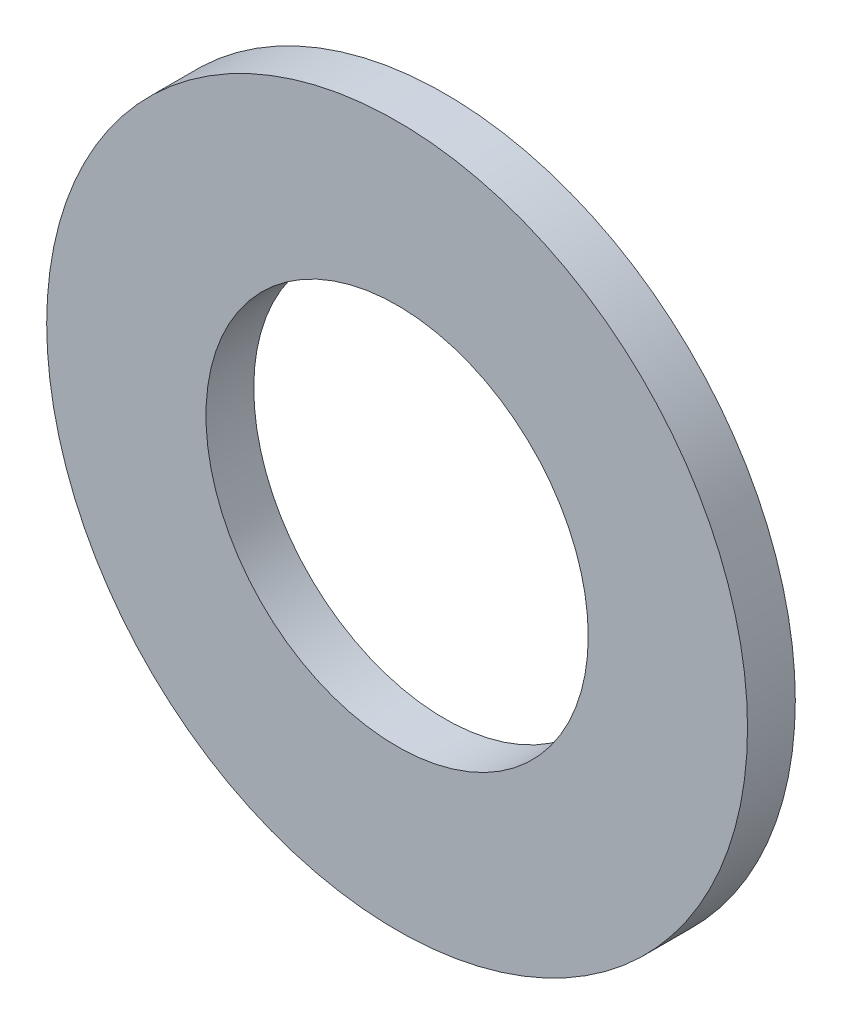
ISO-10303-21;
HEADER;
FILE_DESCRIPTION(('STEP AP214'),'2;1');
FILE_NAME('part.step','',(''),(''),'','','');
FILE_SCHEMA(('AUTOMOTIVE_DESIGN { 1 0 10303 214 1 1 1 1 }'));
ENDSEC;
DATA;
#1=APPLICATION_CONTEXT('core data for automotive mechanical design processes');
#2=APPLICATION_PROTOCOL_DEFINITION('international standard','automotive_design',2000,#1);
#3=PRODUCT_CONTEXT('',#1,'mechanical');
#4=PRODUCT('Part','Part','',(#3));
#5=PRODUCT_RELATED_PRODUCT_CATEGORY('part','',(#4));
#6=PRODUCT_DEFINITION_FORMATION('','',#4);
#7=PRODUCT_DEFINITION_CONTEXT('part definition',#1,'design');
#8=PRODUCT_DEFINITION('design','',#6,#7);
#9=PRODUCT_DEFINITION_SHAPE('','',#8);
#10=(LENGTH_UNIT() NAMED_UNIT(*) SI_UNIT(.MILLI.,.METRE.));
#11=(NAMED_UNIT(*) PLANE_ANGLE_UNIT() SI_UNIT($,.RADIAN.));
#12=(NAMED_UNIT(*) SI_UNIT($,.STERADIAN.) SOLID_ANGLE_UNIT());
#13=UNCERTAINTY_MEASURE_WITH_UNIT(LENGTH_MEASURE(1.E-05),#10,'distance_accuracy_value','');
#14=(GEOMETRIC_REPRESENTATION_CONTEXT(3) GLOBAL_UNCERTAINTY_ASSIGNED_CONTEXT((#13)) GLOBAL_UNIT_ASSIGNED_CONTEXT((#10,
#11,#12)) REPRESENTATION_CONTEXT('',''));
#15=CARTESIAN_POINT('',(0.,0.,0.));
#16=DIRECTION('',(0.,0.,1.));
#17=DIRECTION('',(1.,0.,0.));
#18=AXIS2_PLACEMENT_3D('',#15,#16,#17);
#19=CARTESIAN_POINT('',(-1.99999999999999,380.,-32.6126983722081));
#20=DIRECTION('',(0.,0.,1.));
#21=DIRECTION('',(1.,0.,0.));
#22=AXIS2_PLACEMENT_3D('',#19,#20,#21);
#23=CYLINDRICAL_SURFACE('',#22,11.);
#24=CARTESIAN_POINT('',(-1.99999999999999,380.,0.));
#25=DIRECTION('',(0.,0.,1.));
#26=DIRECTION('',(1.,0.,0.));
#27=AXIS2_PLACEMENT_3D('',#24,#25,#26);
#28=CIRCLE('',#27,11.);
#29=CARTESIAN_POINT('',(9.00000000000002,380.,0.));
#30=VERTEX_POINT('',#29);
#31=EDGE_CURVE('E40',#30,#30,#28,.T.);
#32=ORIENTED_EDGE('',*,*,#31,.F.);
#33=EDGE_LOOP('',(#32));
#34=FACE_BOUND('',#33,.T.);
#35=CARTESIAN_POINT('',(-1.99999999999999,380.,-1.50000000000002));
#36=DIRECTION('',(0.,0.,-1.));
#37=DIRECTION('',(-1.,0.,0.));
#38=AXIS2_PLACEMENT_3D('',#35,#36,#37);
#39=CIRCLE('',#38,11.);
#40=CARTESIAN_POINT('',(-13.,380.,-1.50000000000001));
#41=VERTEX_POINT('',#40);
#42=EDGE_CURVE('E49',#41,#41,#39,.F.);
#43=ORIENTED_EDGE('',*,*,#42,.T.);
#44=EDGE_LOOP('',(#43));
#45=FACE_BOUND('',#44,.T.);
#46=ADVANCED_FACE('F33',(#34,#45),#23,.T.);
#47=CARTESIAN_POINT('',(-1.99999999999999,380.,-32.6126983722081));
#48=DIRECTION('',(0.,0.,1.));
#49=DIRECTION('',(1.,0.,0.));
#50=AXIS2_PLACEMENT_3D('',#47,#48,#49);
#51=CYLINDRICAL_SURFACE('',#50,6.00000000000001);
#52=CARTESIAN_POINT('',(-1.99999999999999,380.,0.));
#53=DIRECTION('',(0.,0.,1.));
#54=DIRECTION('',(1.,0.,0.));
#55=AXIS2_PLACEMENT_3D('',#52,#53,#54);
#56=CIRCLE('',#55,6.00000000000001);
#57=CARTESIAN_POINT('',(4.00000000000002,380.,0.));
#58=VERTEX_POINT('',#57);
#59=EDGE_CURVE('E44',#58,#58,#56,.T.);
#60=ORIENTED_EDGE('',*,*,#59,.T.);
#61=EDGE_LOOP('',(#60));
#62=FACE_BOUND('',#61,.T.);
#63=CARTESIAN_POINT('',(-1.99999999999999,380.,-1.50000000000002));
#64=DIRECTION('',(0.,0.,-1.));
#65=DIRECTION('',(-1.,0.,0.));
#66=AXIS2_PLACEMENT_3D('',#63,#64,#65);
#67=CIRCLE('',#66,6.00000000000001);
#68=CARTESIAN_POINT('',(-7.99999999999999,380.,-1.50000000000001));
#69=VERTEX_POINT('',#68);
#70=EDGE_CURVE('E10',#69,#69,#67,.F.);
#71=ORIENTED_EDGE('',*,*,#70,.F.);
#72=EDGE_LOOP('',(#71));
#73=FACE_BOUND('',#72,.T.);
#74=ADVANCED_FACE('F60',(#62,#73),#51,.F.);
#75=CARTESIAN_POINT('',(-1.99999999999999,380.,0.));
#76=DIRECTION('',(0.,0.,1.));
#77=DIRECTION('',(1.,0.,0.));
#78=AXIS2_PLACEMENT_3D('',#75,#76,#77);
#79=PLANE('',#78);
#80=ORIENTED_EDGE('',*,*,#59,.F.);
#81=EDGE_LOOP('',(#80));
#82=FACE_BOUND('',#81,.T.);
#83=ORIENTED_EDGE('',*,*,#31,.T.);
#84=EDGE_LOOP('',(#83));
#85=FACE_BOUND('',#84,.T.);
#86=ADVANCED_FACE('F56',(#82,#85),#79,.T.);
#87=CARTESIAN_POINT('',(-15.,395.,-1.50000000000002));
#88=DIRECTION('',(0.,0.,-1.));
#89=DIRECTION('',(-1.,0.,0.));
#90=AXIS2_PLACEMENT_3D('',#87,#88,#89);
#91=PLANE('',#90);
#92=ORIENTED_EDGE('',*,*,#42,.F.);
#93=EDGE_LOOP('',(#92));
#94=FACE_BOUND('',#93,.T.);
#95=ORIENTED_EDGE('',*,*,#70,.T.);
#96=EDGE_LOOP('',(#95));
#97=FACE_BOUND('',#96,.T.);
#98=ADVANCED_FACE('F35',(#94,#97),#91,.T.);
#99=CLOSED_SHELL('',(#46,#74,#86,#98));
#100=MANIFOLD_SOLID_BREP('B2',#99);
#101=ADVANCED_BREP_SHAPE_REPRESENTATION('',(#18,#100),#14);
#102=SHAPE_DEFINITION_REPRESENTATION(#9,#101);
ENDSEC;
END-ISO-10303-21;
